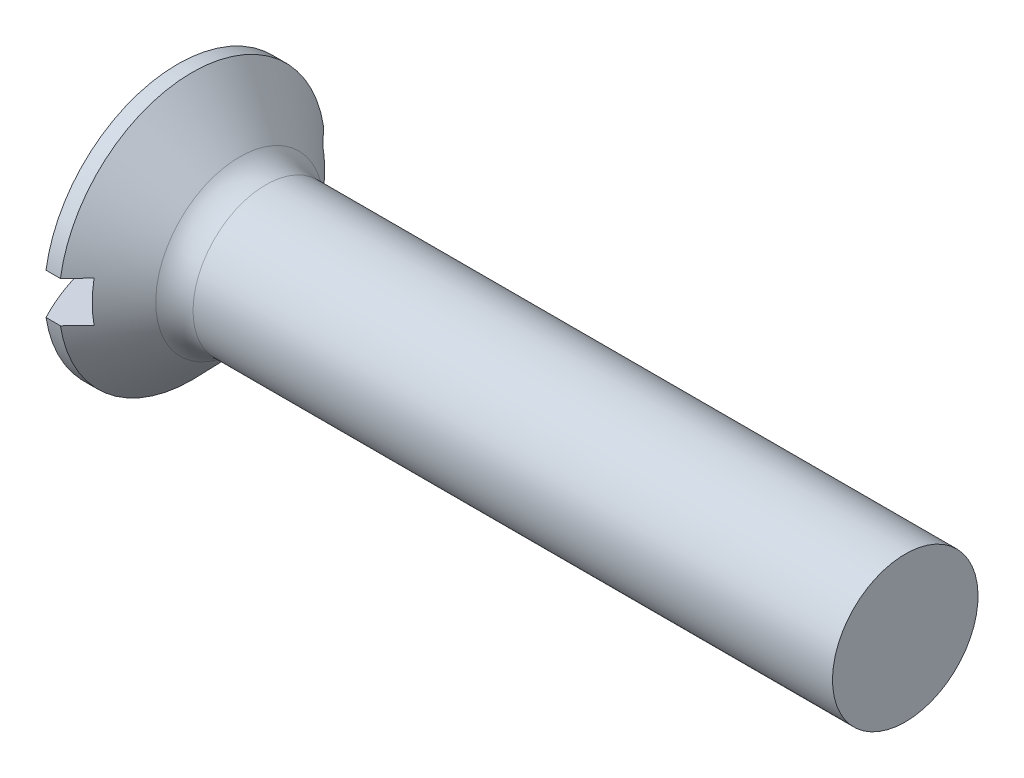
from build123d import *

# Parameters (mm, degrees)
FILLET1_R  = 2.5
SLOTSKE_W  = 18.3
SLOTSKE_H  = 2.81
SLOT_DEPTH = 4.4


with BuildPart() as part:
    # BodySke → BaseBody (revolve)
    with BuildSketch(Plane.XY, mode=Mode.PRIVATE) as basebody_sk:
        with BuildLine():
            Line((2.280026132, 9.15), (3.272417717, 9.15))
            Line((3.272417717, 9.15), (7.280026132, 5))
            Line((7.280026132, 5), (52.280026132, 5))
            Line((52.280026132, 5), (52.280026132, 0))
            Line((52.280026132, 0), (2.280026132, 0))
            Line((2.280026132, 0), (0, 0))
            ThreePointArc((0, 0), (0.578590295, 4.714897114), (2.280026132, 9.15))
        make_face()
    revolve(basebody_sk.sketch.rotate(Axis((2.280026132, 0, 0), (1, 0, 0)), 180), axis=Axis((2.280026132, 0, 0), (1, 0, 0)))

    # Fillet1
    fillet1_edges = [part.edges().sort_by_distance(p)[0] for p in [
        (7.280026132, 5, 0),
    ]]
    fillet(fillet1_edges, radius=FILLET1_R)

    # SlotSke → Slot (cut)
    with BuildSketch(Plane(origin=(0, 0, 0), x_dir=(0, 0, -1), z_dir=(1, 0, 0))):
        Rectangle(SLOTSKE_W, SLOTSKE_H)
    extrude(amount=SLOT_DEPTH, mode=Mode.SUBTRACT)


solid = part.part
